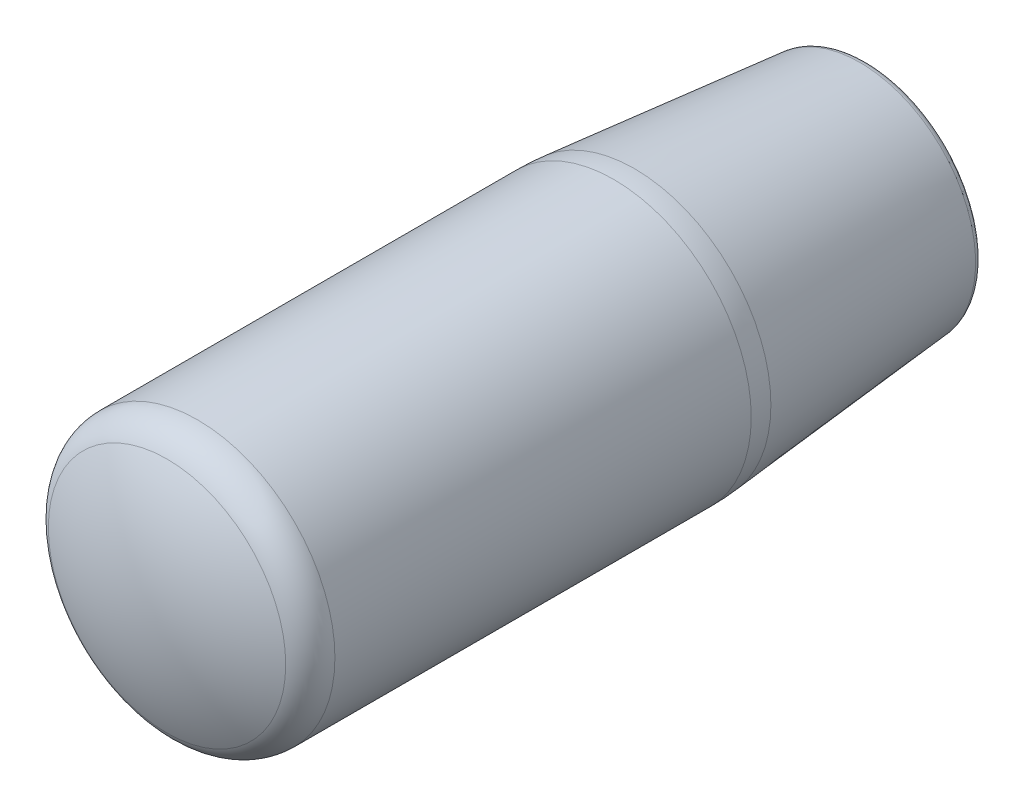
ISO-10303-21;
HEADER;
FILE_DESCRIPTION(('STEP AP214'),'2;1');
FILE_NAME('part.step','',(''),(''),'','','');
FILE_SCHEMA(('AUTOMOTIVE_DESIGN { 1 0 10303 214 1 1 1 1 }'));
ENDSEC;
DATA;
#1=APPLICATION_CONTEXT('core data for automotive mechanical design processes');
#2=APPLICATION_PROTOCOL_DEFINITION('international standard','automotive_design',2000,#1);
#3=PRODUCT_CONTEXT('',#1,'mechanical');
#4=PRODUCT('Part','Part','',(#3));
#5=PRODUCT_RELATED_PRODUCT_CATEGORY('part','',(#4));
#6=PRODUCT_DEFINITION_FORMATION('','',#4);
#7=PRODUCT_DEFINITION_CONTEXT('part definition',#1,'design');
#8=PRODUCT_DEFINITION('design','',#6,#7);
#9=PRODUCT_DEFINITION_SHAPE('','',#8);
#10=(LENGTH_UNIT() NAMED_UNIT(*) SI_UNIT(.MILLI.,.METRE.));
#11=(NAMED_UNIT(*) PLANE_ANGLE_UNIT() SI_UNIT($,.RADIAN.));
#12=(NAMED_UNIT(*) SI_UNIT($,.STERADIAN.) SOLID_ANGLE_UNIT());
#13=UNCERTAINTY_MEASURE_WITH_UNIT(LENGTH_MEASURE(1.E-05),#10,'distance_accuracy_value','');
#14=(GEOMETRIC_REPRESENTATION_CONTEXT(3) GLOBAL_UNCERTAINTY_ASSIGNED_CONTEXT((#13)) GLOBAL_UNIT_ASSIGNED_CONTEXT((#10,
#11,#12)) REPRESENTATION_CONTEXT('',''));
#15=CARTESIAN_POINT('',(0.,0.,0.));
#16=DIRECTION('',(0.,0.,1.));
#17=DIRECTION('',(1.,0.,0.));
#18=AXIS2_PLACEMENT_3D('',#15,#16,#17);
#19=CARTESIAN_POINT('',(0.,5.125,0.));
#20=DIRECTION('',(0.,0.,-1.));
#21=DIRECTION('',(-1.,0.,0.));
#22=AXIS2_PLACEMENT_3D('',#19,#20,#21);
#23=PLANE('',#22);
#24=CARTESIAN_POINT('',(0.,0.,0.));
#25=DIRECTION('',(0.,0.,-1.));
#26=DIRECTION('',(-1.,0.,0.));
#27=AXIS2_PLACEMENT_3D('',#24,#25,#26);
#28=CIRCLE('',#27,9.61163946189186);
#29=CARTESIAN_POINT('',(-9.61163946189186,0.,0.));
#30=VERTEX_POINT('',#29);
#31=EDGE_CURVE('E9',#30,#30,#28,.T.);
#32=ORIENTED_EDGE('',*,*,#31,.T.);
#33=EDGE_LOOP('',(#32));
#34=FACE_BOUND('',#33,.T.);
#35=CARTESIAN_POINT('',(0.,0.,0.));
#36=DIRECTION('',(0.,0.,-1.));
#37=DIRECTION('',(-1.,0.,0.));
#38=AXIS2_PLACEMENT_3D('',#35,#36,#37);
#39=CIRCLE('',#38,5.);
#40=CARTESIAN_POINT('',(-5.,0.,0.));
#41=VERTEX_POINT('',#40);
#42=EDGE_CURVE('E46',#41,#41,#39,.T.);
#43=ORIENTED_EDGE('',*,*,#42,.F.);
#44=EDGE_LOOP('',(#43));
#45=FACE_BOUND('',#44,.T.);
#46=ADVANCED_FACE('F15',(#34,#45),#23,.T.);
#47=CARTESIAN_POINT('',(0.,0.,41.8125));
#48=DIRECTION('',(0.,0.,1.));
#49=DIRECTION('',(0.,1.,0.));
#50=AXIS2_PLACEMENT_3D('',#47,#48,#49);
#51=SPHERICAL_SURFACE('',#50,23.1875);
#52=CARTESIAN_POINT('',(0.,0.,65.));
#53=VERTEX_POINT('',#52);
#54=VERTEX_LOOP('',#53);
#55=FACE_BOUND('',#54,.T.);
#56=CARTESIAN_POINT('',(0.,0.,62.4427029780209));
#57=DIRECTION('',(0.,0.,-1.));
#58=DIRECTION('',(-1.,0.,0.));
#59=AXIS2_PLACEMENT_3D('',#56,#57,#58);
#60=CIRCLE('',#59,10.585597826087);
#61=CARTESIAN_POINT('',(-10.585597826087,0.,62.4427029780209));
#62=VERTEX_POINT('',#61);
#63=EDGE_CURVE('E33',#62,#62,#60,.T.);
#64=ORIENTED_EDGE('',*,*,#63,.F.);
#65=EDGE_LOOP('',(#64));
#66=FACE_BOUND('',#65,.T.);
#67=ADVANCED_FACE('F26',(#55,#66),#51,.T.);
#68=CARTESIAN_POINT('',(0.,0.,21.6666666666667));
#69=DIRECTION('',(0.,0.,1.));
#70=DIRECTION('',(1.,0.,0.));
#71=AXIS2_PLACEMENT_3D('',#68,#69,#70);
#72=CONICAL_SURFACE('',#71,12.25,0.0920468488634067);
#73=CARTESIAN_POINT('',(0.,0.,0.635658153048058));
#74=DIRECTION('',(0.,0.,-1.));
#75=DIRECTION('',(-1.,0.,0.));
#76=AXIS2_PLACEMENT_3D('',#73,#74,#75);
#77=CIRCLE('',#76,10.3086761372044);
#78=CARTESIAN_POINT('',(-10.3086761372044,0.,0.635658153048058));
#79=VERTEX_POINT('',#78);
#80=EDGE_CURVE('E23',#79,#79,#77,.F.);
#81=ORIENTED_EDGE('',*,*,#80,.T.);
#82=EDGE_LOOP('',(#81));
#83=FACE_BOUND('',#82,.T.);
#84=CARTESIAN_POINT('',(0.,0.,20.7494471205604));
#85=DIRECTION('',(0.,0.,-1.));
#86=DIRECTION('',(-1.,0.,0.));
#87=AXIS2_PLACEMENT_3D('',#84,#85,#86);
#88=CIRCLE('',#87,12.1653335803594);
#89=CARTESIAN_POINT('',(-12.1653335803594,0.,20.7494471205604));
#90=VERTEX_POINT('',#89);
#91=EDGE_CURVE('E59',#90,#90,#88,.T.);
#92=ORIENTED_EDGE('',*,*,#91,.T.);
#93=EDGE_LOOP('',(#92));
#94=FACE_BOUND('',#93,.T.);
#95=ADVANCED_FACE('F29',(#83,#94),#72,.T.);
#96=CARTESIAN_POINT('',(0.,0.,59.717959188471));
#97=DIRECTION('',(0.,0.,-1.));
#98=DIRECTION('',(-1.,0.,0.));
#99=AXIS2_PLACEMENT_3D('',#96,#97,#98);
#100=TOROIDAL_SURFACE('',#99,9.1875,3.0625);
#101=ORIENTED_EDGE('',*,*,#63,.T.);
#102=EDGE_LOOP('',(#101));
#103=FACE_BOUND('',#102,.T.);
#104=CARTESIAN_POINT('',(0.,0.,59.717959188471));
#105=DIRECTION('',(0.,0.,1.));
#106=DIRECTION('',(1.,0.,0.));
#107=AXIS2_PLACEMENT_3D('',#104,#105,#106);
#108=CIRCLE('',#107,12.25);
#109=CARTESIAN_POINT('',(12.25,0.,59.717959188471));
#110=VERTEX_POINT('',#109);
#111=EDGE_CURVE('E36',#110,#110,#108,.F.);
#112=ORIENTED_EDGE('',*,*,#111,.F.);
#113=EDGE_LOOP('',(#112));
#114=FACE_BOUND('',#113,.T.);
#115=ADVANCED_FACE('F82',(#103,#114),#100,.T.);
#116=CARTESIAN_POINT('',(0.,0.,40.6923129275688));
#117=DIRECTION('',(0.,0.,1.));
#118=DIRECTION('',(1.,0.,0.));
#119=AXIS2_PLACEMENT_3D('',#116,#117,#118);
#120=CYLINDRICAL_SURFACE('',#119,12.25);
#121=CARTESIAN_POINT('',(0.,0.,22.5877856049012));
#122=DIRECTION('',(0.,0.,-1.));
#123=DIRECTION('',(-1.,0.,0.));
#124=AXIS2_PLACEMENT_3D('',#121,#122,#123);
#125=CIRCLE('',#124,12.25);
#126=CARTESIAN_POINT('',(-12.25,0.,22.5877856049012));
#127=VERTEX_POINT('',#126);
#128=EDGE_CURVE('E43',#127,#127,#125,.F.);
#129=ORIENTED_EDGE('',*,*,#128,.T.);
#130=EDGE_LOOP('',(#129));
#131=FACE_BOUND('',#130,.T.);
#132=ORIENTED_EDGE('',*,*,#111,.T.);
#133=EDGE_LOOP('',(#132));
#134=FACE_BOUND('',#133,.T.);
#135=ADVANCED_FACE('F79',(#131,#134),#120,.T.);
#136=CARTESIAN_POINT('',(0.,0.,7.));
#137=DIRECTION('',(0.,0.,-1.));
#138=DIRECTION('',(-1.,0.,0.));
#139=AXIS2_PLACEMENT_3D('',#136,#137,#138);
#140=CYLINDRICAL_SURFACE('',#139,5.);
#141=CARTESIAN_POINT('',(0.,0.,7.));
#142=DIRECTION('',(0.,0.,-1.));
#143=DIRECTION('',(-1.,0.,0.));
#144=AXIS2_PLACEMENT_3D('',#141,#142,#143);
#145=CIRCLE('',#144,5.);
#146=CARTESIAN_POINT('',(-5.,0.,7.));
#147=VERTEX_POINT('',#146);
#148=EDGE_CURVE('E37',#147,#147,#145,.T.);
#149=ORIENTED_EDGE('',*,*,#148,.F.);
#150=EDGE_LOOP('',(#149));
#151=FACE_BOUND('',#150,.T.);
#152=ORIENTED_EDGE('',*,*,#42,.T.);
#153=EDGE_LOOP('',(#152));
#154=FACE_BOUND('',#153,.T.);
#155=ADVANCED_FACE('F81',(#151,#154),#140,.F.);
#156=CARTESIAN_POINT('',(0.,4.125,7.));
#157=DIRECTION('',(0.,0.,1.));
#158=DIRECTION('',(1.,0.,0.));
#159=AXIS2_PLACEMENT_3D('',#156,#157,#158);
#160=PLANE('',#159);
#161=CARTESIAN_POINT('',(0.,0.,7.));
#162=DIRECTION('',(0.,0.,1.));
#163=DIRECTION('',(1.,0.,0.));
#164=AXIS2_PLACEMENT_3D('',#161,#162,#163);
#165=CIRCLE('',#164,4.);
#166=CARTESIAN_POINT('',(4.,0.,7.));
#167=VERTEX_POINT('',#166);
#168=EDGE_CURVE('E101',#167,#167,#165,.T.);
#169=ORIENTED_EDGE('',*,*,#168,.T.);
#170=EDGE_LOOP('',(#169));
#171=FACE_BOUND('',#170,.T.);
#172=ORIENTED_EDGE('',*,*,#148,.T.);
#173=EDGE_LOOP('',(#172));
#174=FACE_BOUND('',#173,.T.);
#175=ADVANCED_FACE('F90',(#171,#174),#160,.F.);
#176=CARTESIAN_POINT('',(0.,0.,30.));
#177=DIRECTION('',(0.,0.,-1.));
#178=DIRECTION('',(-1.,0.,0.));
#179=AXIS2_PLACEMENT_3D('',#176,#177,#178);
#180=CYLINDRICAL_SURFACE('',#179,4.);
#181=CARTESIAN_POINT('',(0.,0.,30.));
#182=DIRECTION('',(0.,0.,-1.));
#183=DIRECTION('',(-1.,0.,0.));
#184=AXIS2_PLACEMENT_3D('',#181,#182,#183);
#185=CIRCLE('',#184,4.);
#186=CARTESIAN_POINT('',(-4.,0.,30.));
#187=VERTEX_POINT('',#186);
#188=EDGE_CURVE('E106',#187,#187,#185,.T.);
#189=ORIENTED_EDGE('',*,*,#188,.F.);
#190=EDGE_LOOP('',(#189));
#191=FACE_BOUND('',#190,.T.);
#192=ORIENTED_EDGE('',*,*,#168,.F.);
#193=EDGE_LOOP('',(#192));
#194=FACE_BOUND('',#193,.T.);
#195=ADVANCED_FACE('F112',(#191,#194),#180,.F.);
#196=CARTESIAN_POINT('',(0.,0.,30.));
#197=DIRECTION('',(0.,0.,-1.));
#198=DIRECTION('',(-1.,0.,0.));
#199=AXIS2_PLACEMENT_3D('',#196,#197,#198);
#200=PLANE('',#199);
#201=ORIENTED_EDGE('',*,*,#188,.T.);
#202=EDGE_LOOP('',(#201));
#203=FACE_BOUND('',#202,.T.);
#204=ADVANCED_FACE('F76',(#203),#200,.T.);
#205=CARTESIAN_POINT('',(0.,0.,22.5877856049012));
#206=DIRECTION('',(0.,0.,-1.));
#207=DIRECTION('',(-1.,0.,0.));
#208=AXIS2_PLACEMENT_3D('',#205,#206,#207);
#209=DEGENERATE_TOROIDAL_SURFACE('',#208,7.75,20.,.F.);
#210=ORIENTED_EDGE('',*,*,#91,.F.);
#211=EDGE_LOOP('',(#210));
#212=FACE_BOUND('',#211,.T.);
#213=ORIENTED_EDGE('',*,*,#128,.F.);
#214=EDGE_LOOP('',(#213));
#215=FACE_BOUND('',#214,.T.);
#216=ADVANCED_FACE('F69',(#212,#215),#209,.F.);
#217=CARTESIAN_POINT('',(0.,0.,0.7));
#218=DIRECTION('',(0.,0.,-1.));
#219=DIRECTION('',(-1.,0.,0.));
#220=AXIS2_PLACEMENT_3D('',#217,#218,#219);
#221=TOROIDAL_SURFACE('',#220,9.61163946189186,0.7);
#222=ORIENTED_EDGE('',*,*,#31,.F.);
#223=EDGE_LOOP('',(#222));
#224=FACE_BOUND('',#223,.T.);
#225=ORIENTED_EDGE('',*,*,#80,.F.);
#226=EDGE_LOOP('',(#225));
#227=FACE_BOUND('',#226,.T.);
#228=ADVANCED_FACE('F17',(#224,#227),#221,.T.);
#229=CLOSED_SHELL('',(#46,#67,#95,#115,#135,#155,#175,#195,#204,#216,#228));
#230=MANIFOLD_SOLID_BREP('B1',#229);
#231=ADVANCED_BREP_SHAPE_REPRESENTATION('',(#18,#230),#14);
#232=SHAPE_DEFINITION_REPRESENTATION(#9,#231);
ENDSEC;
END-ISO-10303-21;
